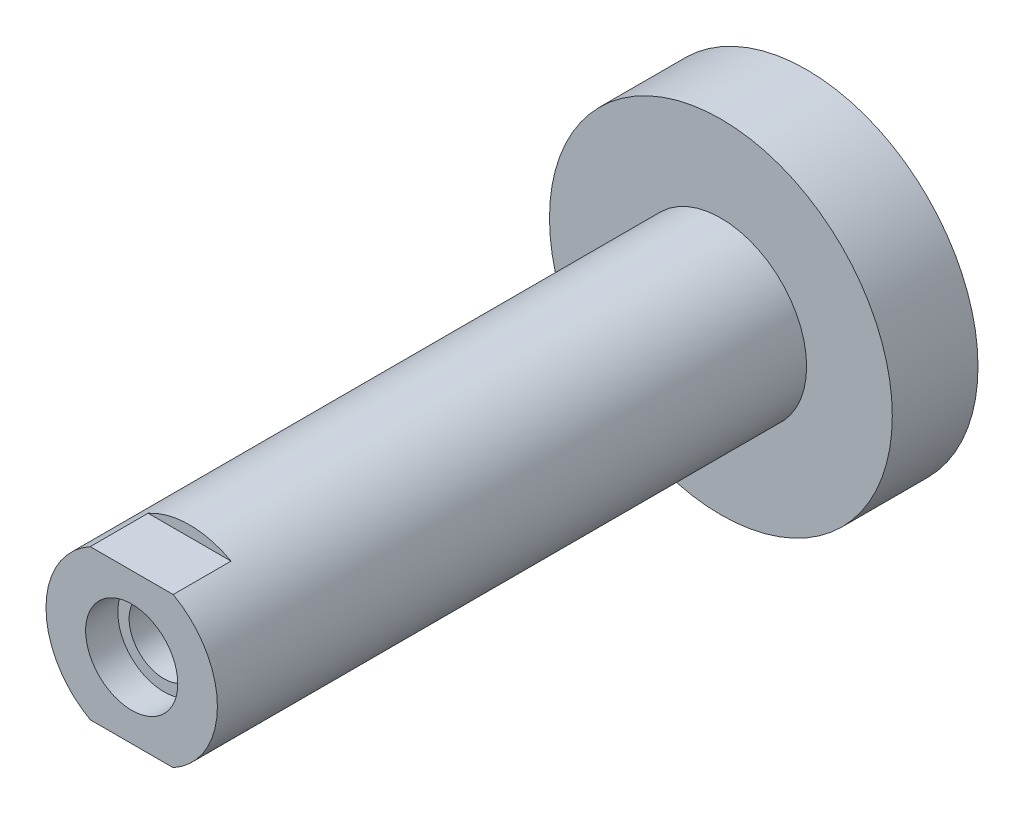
ISO-10303-21;
HEADER;
FILE_DESCRIPTION(('STEP AP214'),'2;1');
FILE_NAME('part.step','',(''),(''),'','','');
FILE_SCHEMA(('AUTOMOTIVE_DESIGN { 1 0 10303 214 1 1 1 1 }'));
ENDSEC;
DATA;
#1=APPLICATION_CONTEXT('core data for automotive mechanical design processes');
#2=APPLICATION_PROTOCOL_DEFINITION('international standard','automotive_design',2000,#1);
#3=PRODUCT_CONTEXT('',#1,'mechanical');
#4=PRODUCT('Part','Part','',(#3));
#5=PRODUCT_RELATED_PRODUCT_CATEGORY('part','',(#4));
#6=PRODUCT_DEFINITION_FORMATION('','',#4);
#7=PRODUCT_DEFINITION_CONTEXT('part definition',#1,'design');
#8=PRODUCT_DEFINITION('design','',#6,#7);
#9=PRODUCT_DEFINITION_SHAPE('','',#8);
#10=(LENGTH_UNIT() NAMED_UNIT(*) SI_UNIT(.MILLI.,.METRE.));
#11=(NAMED_UNIT(*) PLANE_ANGLE_UNIT() SI_UNIT($,.RADIAN.));
#12=(NAMED_UNIT(*) SI_UNIT($,.STERADIAN.) SOLID_ANGLE_UNIT());
#13=UNCERTAINTY_MEASURE_WITH_UNIT(LENGTH_MEASURE(1.E-05),#10,'distance_accuracy_value','');
#14=(GEOMETRIC_REPRESENTATION_CONTEXT(3) GLOBAL_UNCERTAINTY_ASSIGNED_CONTEXT((#13)) GLOBAL_UNIT_ASSIGNED_CONTEXT((#10,
#11,#12)) REPRESENTATION_CONTEXT('',''));
#15=CARTESIAN_POINT('',(0.,0.,0.));
#16=DIRECTION('',(0.,0.,1.));
#17=DIRECTION('',(1.,0.,0.));
#18=AXIS2_PLACEMENT_3D('',#15,#16,#17);
#19=CARTESIAN_POINT('',(0.,0.,-7.000000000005));
#20=DIRECTION('',(0.,0.,1.));
#21=DIRECTION('',(1.,0.,0.));
#22=AXIS2_PLACEMENT_3D('',#19,#20,#21);
#23=CONICAL_SURFACE('',#22,1.62100000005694,0.785398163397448);
#24=CARTESIAN_POINT('',(0.,0.,-8.6210000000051));
#25=VERTEX_POINT('',#24);
#26=VERTEX_LOOP('',#25);
#27=FACE_BOUND('',#26,.T.);
#28=CARTESIAN_POINT('',(0.,0.,-7.));
#29=DIRECTION('',(0.,0.,1.));
#30=DIRECTION('',(1.,0.,0.));
#31=AXIS2_PLACEMENT_3D('',#28,#29,#30);
#32=CIRCLE('',#31,1.621);
#33=CARTESIAN_POINT('',(1.621,0.,-7.));
#34=VERTEX_POINT('',#33);
#35=EDGE_CURVE('E90',#34,#34,#32,.T.);
#36=ORIENTED_EDGE('',*,*,#35,.T.);
#37=EDGE_LOOP('',(#36));
#38=FACE_BOUND('',#37,.T.);
#39=ADVANCED_FACE('F17',(#27,#38),#23,.F.);
#40=CARTESIAN_POINT('',(0.,0.,-2.));
#41=DIRECTION('',(0.,0.,1.));
#42=DIRECTION('',(1.,0.,0.));
#43=AXIS2_PLACEMENT_3D('',#40,#41,#42);
#44=CYLINDRICAL_SURFACE('',#43,1.621);
#45=CARTESIAN_POINT('',(0.,0.,3.));
#46=DIRECTION('',(0.,0.,1.));
#47=DIRECTION('',(1.,0.,0.));
#48=AXIS2_PLACEMENT_3D('',#45,#46,#47);
#49=CIRCLE('',#48,1.621);
#50=CARTESIAN_POINT('',(1.621,0.,3.));
#51=VERTEX_POINT('',#50);
#52=EDGE_CURVE('E21',#51,#51,#49,.T.);
#53=ORIENTED_EDGE('',*,*,#52,.T.);
#54=EDGE_LOOP('',(#53));
#55=FACE_BOUND('',#54,.T.);
#56=ORIENTED_EDGE('',*,*,#35,.F.);
#57=EDGE_LOOP('',(#56));
#58=FACE_BOUND('',#57,.T.);
#59=ADVANCED_FACE('F111',(#55,#58),#44,.F.);
#60=CARTESIAN_POINT('',(0.,-4.,-27.));
#61=DIRECTION('',(0.,0.,-1.));
#62=DIRECTION('',(-1.,0.,0.));
#63=AXIS2_PLACEMENT_3D('',#60,#61,#62);
#64=PLANE('',#63);
#65=CARTESIAN_POINT('',(0.,0.,-27.));
#66=DIRECTION('',(0.,0.,1.));
#67=DIRECTION('',(1.,0.,0.));
#68=AXIS2_PLACEMENT_3D('',#65,#66,#67);
#69=CIRCLE('',#68,8.);
#70=CARTESIAN_POINT('',(8.,0.,-27.));
#71=VERTEX_POINT('',#70);
#72=EDGE_CURVE('E104',#71,#71,#69,.T.);
#73=ORIENTED_EDGE('',*,*,#72,.F.);
#74=EDGE_LOOP('',(#73));
#75=FACE_BOUND('',#74,.T.);
#76=ADVANCED_FACE('F118',(#75),#64,.T.);
#77=CARTESIAN_POINT('',(0.,-1.8855,3.));
#78=DIRECTION('',(0.,0.,-1.));
#79=DIRECTION('',(-1.,0.,0.));
#80=AXIS2_PLACEMENT_3D('',#77,#78,#79);
#81=PLANE('',#80);
#82=ORIENTED_EDGE('',*,*,#52,.F.);
#83=EDGE_LOOP('',(#82));
#84=FACE_BOUND('',#83,.T.);
#85=CARTESIAN_POINT('',(0.,0.,3.));
#86=DIRECTION('',(0.,0.,1.));
#87=DIRECTION('',(1.,0.,0.));
#88=AXIS2_PLACEMENT_3D('',#85,#86,#87);
#89=CIRCLE('',#88,2.15);
#90=CARTESIAN_POINT('',(2.15,0.,3.));
#91=VERTEX_POINT('',#90);
#92=EDGE_CURVE('E102',#91,#91,#89,.T.);
#93=ORIENTED_EDGE('',*,*,#92,.T.);
#94=EDGE_LOOP('',(#93));
#95=FACE_BOUND('',#94,.T.);
#96=ADVANCED_FACE('F114',(#84,#95),#81,.F.);
#97=CARTESIAN_POINT('',(0.,0.,-25.));
#98=DIRECTION('',(0.,0.,1.));
#99=DIRECTION('',(1.,0.,0.));
#100=AXIS2_PLACEMENT_3D('',#97,#98,#99);
#101=CYLINDRICAL_SURFACE('',#100,8.);
#102=CARTESIAN_POINT('',(0.,0.,-23.));
#103=DIRECTION('',(0.,0.,1.));
#104=DIRECTION('',(1.,0.,0.));
#105=AXIS2_PLACEMENT_3D('',#102,#103,#104);
#106=CIRCLE('',#105,8.);
#107=CARTESIAN_POINT('',(8.,0.,-23.));
#108=VERTEX_POINT('',#107);
#109=EDGE_CURVE('E89',#108,#108,#106,.T.);
#110=ORIENTED_EDGE('',*,*,#109,.F.);
#111=EDGE_LOOP('',(#110));
#112=FACE_BOUND('',#111,.T.);
#113=ORIENTED_EDGE('',*,*,#72,.T.);
#114=EDGE_LOOP('',(#113));
#115=FACE_BOUND('',#114,.T.);
#116=ADVANCED_FACE('F117',(#112,#115),#101,.T.);
#117=CARTESIAN_POINT('',(0.,0.,3.75));
#118=DIRECTION('',(0.,0.,1.));
#119=DIRECTION('',(1.,0.,0.));
#120=AXIS2_PLACEMENT_3D('',#117,#118,#119);
#121=CYLINDRICAL_SURFACE('',#120,2.15);
#122=CARTESIAN_POINT('',(0.,0.,4.5));
#123=DIRECTION('',(0.,0.,1.));
#124=DIRECTION('',(1.,0.,0.));
#125=AXIS2_PLACEMENT_3D('',#122,#123,#124);
#126=CIRCLE('',#125,2.15);
#127=CARTESIAN_POINT('',(2.15,0.,4.5));
#128=VERTEX_POINT('',#127);
#129=EDGE_CURVE('E85',#128,#128,#126,.F.);
#130=ORIENTED_EDGE('',*,*,#129,.F.);
#131=EDGE_LOOP('',(#130));
#132=FACE_BOUND('',#131,.T.);
#133=ORIENTED_EDGE('',*,*,#92,.F.);
#134=EDGE_LOOP('',(#133));
#135=FACE_BOUND('',#134,.T.);
#136=ADVANCED_FACE('F122',(#132,#135),#121,.F.);
#137=CARTESIAN_POINT('',(0.,-6.,-23.));
#138=DIRECTION('',(0.,0.,1.));
#139=DIRECTION('',(1.,0.,0.));
#140=AXIS2_PLACEMENT_3D('',#137,#138,#139);
#141=PLANE('',#140);
#142=ORIENTED_EDGE('',*,*,#109,.T.);
#143=EDGE_LOOP('',(#142));
#144=FACE_BOUND('',#143,.T.);
#145=CARTESIAN_POINT('',(0.,0.,-23.));
#146=DIRECTION('',(0.,0.,1.));
#147=DIRECTION('',(1.,0.,0.));
#148=AXIS2_PLACEMENT_3D('',#145,#146,#147);
#149=CIRCLE('',#148,4.);
#150=CARTESIAN_POINT('',(4.,0.,-23.));
#151=VERTEX_POINT('',#150);
#152=EDGE_CURVE('E75',#151,#151,#149,.T.);
#153=ORIENTED_EDGE('',*,*,#152,.F.);
#154=EDGE_LOOP('',(#153));
#155=FACE_BOUND('',#154,.T.);
#156=ADVANCED_FACE('F124',(#144,#155),#141,.T.);
#157=CARTESIAN_POINT('',(0.,0.,1.8));
#158=DIRECTION('',(0.,0.,1.));
#159=DIRECTION('',(1.,0.,0.));
#160=AXIS2_PLACEMENT_3D('',#157,#158,#159);
#161=PLANE('',#160);
#162=DIRECTION('',(1.,0.,0.));
#163=VECTOR('',#162,1.);
#164=CARTESIAN_POINT('',(-7.,3.5,1.8));
#165=LINE('',#164,#163);
#166=CARTESIAN_POINT('',(-1.93649167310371,3.5,1.8));
#167=VERTEX_POINT('',#166);
#168=CARTESIAN_POINT('',(1.93649167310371,3.5,1.8));
#169=VERTEX_POINT('',#168);
#170=EDGE_CURVE('E84',#167,#169,#165,.T.);
#171=ORIENTED_EDGE('',*,*,#170,.T.);
#172=CARTESIAN_POINT('',(0.,0.,1.8));
#173=DIRECTION('',(0.,0.,1.));
#174=DIRECTION('',(1.,0.,0.));
#175=AXIS2_PLACEMENT_3D('',#172,#173,#174);
#176=CIRCLE('',#175,4.);
#177=EDGE_CURVE('E83',#167,#169,#176,.F.);
#178=ORIENTED_EDGE('',*,*,#177,.F.);
#179=EDGE_LOOP('',(#171,#178));
#180=FACE_BOUND('',#179,.T.);
#181=ADVANCED_FACE('F132',(#180),#161,.T.);
#182=CARTESIAN_POINT('',(-7.,3.5,7.2));
#183=DIRECTION('',(0.,-1.,0.));
#184=DIRECTION('',(1.,0.,0.));
#185=AXIS2_PLACEMENT_3D('',#182,#183,#184);
#186=PLANE('',#185);
#187=ORIENTED_EDGE('',*,*,#170,.F.);
#188=DIRECTION('',(0.,0.,1.));
#189=VECTOR('',#188,1.);
#190=CARTESIAN_POINT('',(-1.93649167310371,3.5,7.2));
#191=LINE('',#190,#189);
#192=CARTESIAN_POINT('',(-1.93649167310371,3.5,4.5));
#193=VERTEX_POINT('',#192);
#194=EDGE_CURVE('E86',#193,#167,#191,.F.);
#195=ORIENTED_EDGE('',*,*,#194,.F.);
#196=DIRECTION('',(1.,0.,0.));
#197=VECTOR('',#196,1.);
#198=CARTESIAN_POINT('',(0.,3.5,4.5));
#199=LINE('',#198,#197);
#200=CARTESIAN_POINT('',(1.93649167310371,3.5,4.5));
#201=VERTEX_POINT('',#200);
#202=EDGE_CURVE('E70',#201,#193,#199,.F.);
#203=ORIENTED_EDGE('',*,*,#202,.F.);
#204=DIRECTION('',(0.,0.,1.));
#205=VECTOR('',#204,1.);
#206=CARTESIAN_POINT('',(1.93649167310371,3.5,-9.25));
#207=LINE('',#206,#205);
#208=EDGE_CURVE('E79',#169,#201,#207,.T.);
#209=ORIENTED_EDGE('',*,*,#208,.F.);
#210=EDGE_LOOP('',(#187,#195,#203,#209));
#211=FACE_BOUND('',#210,.T.);
#212=ADVANCED_FACE('F154',(#211),#186,.F.);
#213=CARTESIAN_POINT('',(0.,-2.,4.5));
#214=DIRECTION('',(0.,0.,1.));
#215=DIRECTION('',(1.,0.,0.));
#216=AXIS2_PLACEMENT_3D('',#213,#214,#215);
#217=PLANE('',#216);
#218=DIRECTION('',(-1.,0.,0.));
#219=VECTOR('',#218,1.);
#220=CARTESIAN_POINT('',(7.,-3.5,4.5));
#221=LINE('',#220,#219);
#222=CARTESIAN_POINT('',(-1.93649167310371,-3.5,4.5));
#223=VERTEX_POINT('',#222);
#224=CARTESIAN_POINT('',(1.93649167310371,-3.5,4.5));
#225=VERTEX_POINT('',#224);
#226=EDGE_CURVE('E64',#223,#225,#221,.F.);
#227=ORIENTED_EDGE('',*,*,#226,.T.);
#228=CARTESIAN_POINT('',(0.,0.,4.5));
#229=DIRECTION('',(0.,0.,1.));
#230=DIRECTION('',(1.,0.,0.));
#231=AXIS2_PLACEMENT_3D('',#228,#229,#230);
#232=CIRCLE('',#231,4.);
#233=EDGE_CURVE('E82',#201,#225,#232,.F.);
#234=ORIENTED_EDGE('',*,*,#233,.F.);
#235=ORIENTED_EDGE('',*,*,#202,.T.);
#236=CARTESIAN_POINT('',(0.,0.,4.5));
#237=DIRECTION('',(0.,0.,1.));
#238=DIRECTION('',(1.,0.,0.));
#239=AXIS2_PLACEMENT_3D('',#236,#237,#238);
#240=CIRCLE('',#239,4.);
#241=EDGE_CURVE('E61',#193,#223,#240,.T.);
#242=ORIENTED_EDGE('',*,*,#241,.T.);
#243=EDGE_LOOP('',(#227,#234,#235,#242));
#244=FACE_BOUND('',#243,.T.);
#245=ORIENTED_EDGE('',*,*,#129,.T.);
#246=EDGE_LOOP('',(#245));
#247=FACE_BOUND('',#246,.T.);
#248=ADVANCED_FACE('F67',(#244,#247),#217,.T.);
#249=CARTESIAN_POINT('',(7.,-3.5,7.2));
#250=DIRECTION('',(0.,1.,0.));
#251=DIRECTION('',(-1.,0.,0.));
#252=AXIS2_PLACEMENT_3D('',#249,#250,#251);
#253=PLANE('',#252);
#254=ORIENTED_EDGE('',*,*,#226,.F.);
#255=DIRECTION('',(0.,0.,1.));
#256=VECTOR('',#255,1.);
#257=CARTESIAN_POINT('',(-1.93649167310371,-3.5,7.2));
#258=LINE('',#257,#256);
#259=CARTESIAN_POINT('',(-1.93649167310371,-3.5,1.8));
#260=VERTEX_POINT('',#259);
#261=EDGE_CURVE('E57',#260,#223,#258,.T.);
#262=ORIENTED_EDGE('',*,*,#261,.F.);
#263=DIRECTION('',(1.,0.,0.));
#264=VECTOR('',#263,1.);
#265=CARTESIAN_POINT('',(0.,-3.5,1.8));
#266=LINE('',#265,#264);
#267=CARTESIAN_POINT('',(1.93649167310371,-3.5,1.8));
#268=VERTEX_POINT('',#267);
#269=EDGE_CURVE('E36',#268,#260,#266,.F.);
#270=ORIENTED_EDGE('',*,*,#269,.F.);
#271=DIRECTION('',(0.,0.,1.));
#272=VECTOR('',#271,1.);
#273=CARTESIAN_POINT('',(1.93649167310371,-3.5,-9.25));
#274=LINE('',#273,#272);
#275=EDGE_CURVE('E27',#225,#268,#274,.F.);
#276=ORIENTED_EDGE('',*,*,#275,.F.);
#277=EDGE_LOOP('',(#254,#262,#270,#276));
#278=FACE_BOUND('',#277,.T.);
#279=ADVANCED_FACE('F72',(#278),#253,.F.);
#280=CARTESIAN_POINT('',(0.,0.,1.8));
#281=DIRECTION('',(0.,0.,1.));
#282=DIRECTION('',(1.,0.,0.));
#283=AXIS2_PLACEMENT_3D('',#280,#281,#282);
#284=PLANE('',#283);
#285=ORIENTED_EDGE('',*,*,#269,.T.);
#286=CARTESIAN_POINT('',(0.,0.,1.8));
#287=DIRECTION('',(0.,0.,1.));
#288=DIRECTION('',(1.,0.,0.));
#289=AXIS2_PLACEMENT_3D('',#286,#287,#288);
#290=CIRCLE('',#289,4.);
#291=EDGE_CURVE('E11',#268,#260,#290,.F.);
#292=ORIENTED_EDGE('',*,*,#291,.F.);
#293=EDGE_LOOP('',(#285,#292));
#294=FACE_BOUND('',#293,.T.);
#295=ADVANCED_FACE('F139',(#294),#284,.T.);
#296=CARTESIAN_POINT('',(0.,0.,-9.25));
#297=DIRECTION('',(0.,0.,1.));
#298=DIRECTION('',(1.,0.,0.));
#299=AXIS2_PLACEMENT_3D('',#296,#297,#298);
#300=CYLINDRICAL_SURFACE('',#299,4.);
#301=ORIENTED_EDGE('',*,*,#152,.T.);
#302=EDGE_LOOP('',(#301));
#303=FACE_BOUND('',#302,.T.);
#304=ORIENTED_EDGE('',*,*,#275,.T.);
#305=ORIENTED_EDGE('',*,*,#291,.T.);
#306=ORIENTED_EDGE('',*,*,#261,.T.);
#307=ORIENTED_EDGE('',*,*,#241,.F.);
#308=ORIENTED_EDGE('',*,*,#194,.T.);
#309=ORIENTED_EDGE('',*,*,#177,.T.);
#310=ORIENTED_EDGE('',*,*,#208,.T.);
#311=ORIENTED_EDGE('',*,*,#233,.T.);
#312=EDGE_LOOP('',(#304,#305,#306,#307,#308,#309,#310,#311));
#313=FACE_BOUND('',#312,.T.);
#314=ADVANCED_FACE('F19',(#303,#313),#300,.T.);
#315=CLOSED_SHELL('',(#39,#59,#76,#96,#116,#136,#156,#181,#212,#248,#279,#295,#314));
#316=MANIFOLD_SOLID_BREP('B1',#315);
#317=ADVANCED_BREP_SHAPE_REPRESENTATION('',(#18,#316),#14);
#318=SHAPE_DEFINITION_REPRESENTATION(#9,#317);
ENDSEC;
END-ISO-10303-21;
